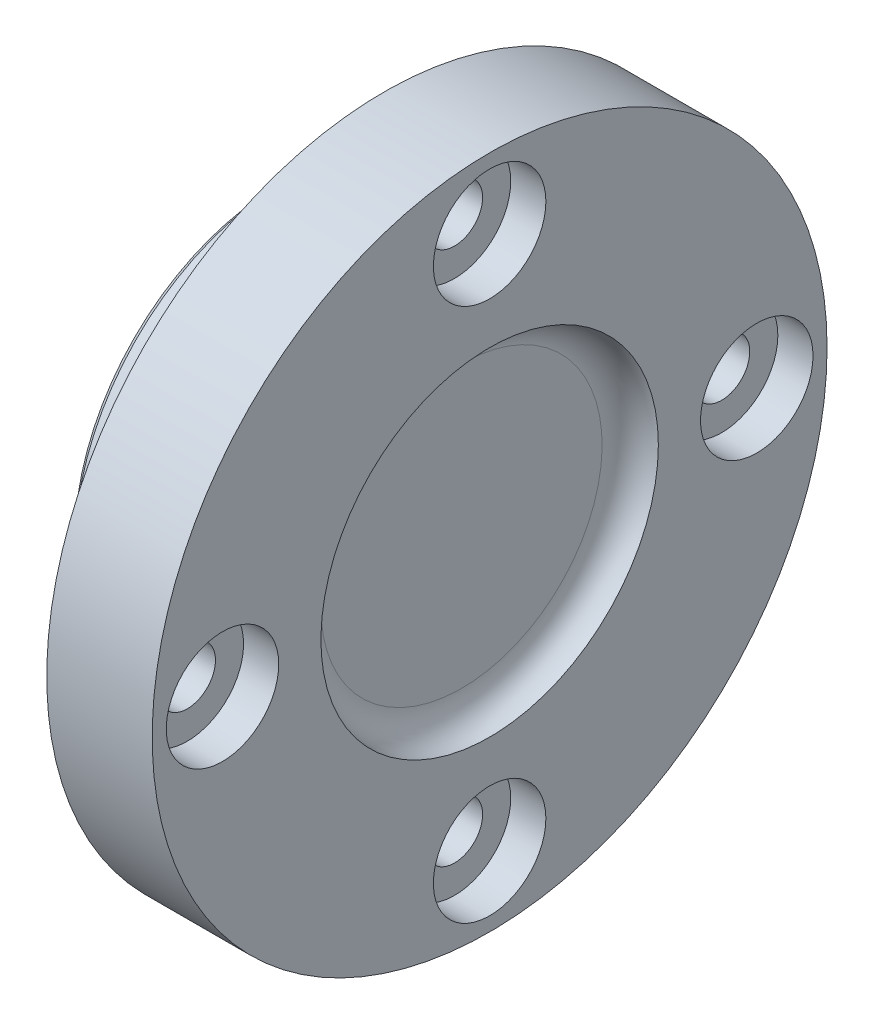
ISO-10303-21;
HEADER;
FILE_DESCRIPTION(('STEP AP214'),'2;1');
FILE_NAME('part.step','',(''),(''),'','','');
FILE_SCHEMA(('AUTOMOTIVE_DESIGN { 1 0 10303 214 1 1 1 1 }'));
ENDSEC;
DATA;
#1=APPLICATION_CONTEXT('core data for automotive mechanical design processes');
#2=APPLICATION_PROTOCOL_DEFINITION('international standard','automotive_design',2000,#1);
#3=PRODUCT_CONTEXT('',#1,'mechanical');
#4=PRODUCT('Part','Part','',(#3));
#5=PRODUCT_RELATED_PRODUCT_CATEGORY('part','',(#4));
#6=PRODUCT_DEFINITION_FORMATION('','',#4);
#7=PRODUCT_DEFINITION_CONTEXT('part definition',#1,'design');
#8=PRODUCT_DEFINITION('design','',#6,#7);
#9=PRODUCT_DEFINITION_SHAPE('','',#8);
#10=(LENGTH_UNIT() NAMED_UNIT(*) SI_UNIT(.MILLI.,.METRE.));
#11=(NAMED_UNIT(*) PLANE_ANGLE_UNIT() SI_UNIT($,.RADIAN.));
#12=(NAMED_UNIT(*) SI_UNIT($,.STERADIAN.) SOLID_ANGLE_UNIT());
#13=UNCERTAINTY_MEASURE_WITH_UNIT(LENGTH_MEASURE(1.E-05),#10,'distance_accuracy_value','');
#14=(GEOMETRIC_REPRESENTATION_CONTEXT(3) GLOBAL_UNCERTAINTY_ASSIGNED_CONTEXT((#13)) GLOBAL_UNIT_ASSIGNED_CONTEXT((#10,
#11,#12)) REPRESENTATION_CONTEXT('',''));
#15=CARTESIAN_POINT('',(0.,0.,0.));
#16=DIRECTION('',(0.,0.,1.));
#17=DIRECTION('',(1.,0.,0.));
#18=AXIS2_PLACEMENT_3D('',#15,#16,#17);
#19=CARTESIAN_POINT('',(15.,48.,0.));
#20=DIRECTION('',(-1.,0.,0.));
#21=DIRECTION('',(0.,0.,1.));
#22=AXIS2_PLACEMENT_3D('',#19,#20,#21);
#23=PLANE('',#22);
#24=CARTESIAN_POINT('',(15.,0.,-38.));
#25=DIRECTION('',(-1.,0.,0.));
#26=DIRECTION('',(0.,0.,1.));
#27=AXIS2_PLACEMENT_3D('',#24,#25,#26);
#28=CIRCLE('',#27,4.00000000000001);
#29=CARTESIAN_POINT('',(15.,0.,-34.));
#30=VERTEX_POINT('',#29);
#31=EDGE_CURVE('E151',#30,#30,#28,.T.);
#32=ORIENTED_EDGE('',*,*,#31,.F.);
#33=EDGE_LOOP('',(#32));
#34=FACE_BOUND('',#33,.T.);
#35=CARTESIAN_POINT('',(15.,38.,0.));
#36=DIRECTION('',(-1.,0.,0.));
#37=DIRECTION('',(0.,0.,1.));
#38=AXIS2_PLACEMENT_3D('',#35,#36,#37);
#39=CIRCLE('',#38,4.00000000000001);
#40=CARTESIAN_POINT('',(15.,38.,4.00000000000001));
#41=VERTEX_POINT('',#40);
#42=EDGE_CURVE('E139',#41,#41,#39,.T.);
#43=ORIENTED_EDGE('',*,*,#42,.F.);
#44=EDGE_LOOP('',(#43));
#45=FACE_BOUND('',#44,.T.);
#46=CARTESIAN_POINT('',(15.,-38.,0.));
#47=DIRECTION('',(-1.,0.,0.));
#48=DIRECTION('',(0.,0.,1.));
#49=AXIS2_PLACEMENT_3D('',#46,#47,#48);
#50=CIRCLE('',#49,4.00000000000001);
#51=CARTESIAN_POINT('',(15.,-38.,4.00000000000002));
#52=VERTEX_POINT('',#51);
#53=EDGE_CURVE('E127',#52,#52,#50,.T.);
#54=ORIENTED_EDGE('',*,*,#53,.F.);
#55=EDGE_LOOP('',(#54));
#56=FACE_BOUND('',#55,.T.);
#57=CARTESIAN_POINT('',(15.,0.,38.));
#58=DIRECTION('',(-1.,0.,0.));
#59=DIRECTION('',(0.,0.,1.));
#60=AXIS2_PLACEMENT_3D('',#57,#58,#59);
#61=CIRCLE('',#60,4.00000000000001);
#62=CARTESIAN_POINT('',(15.,0.,42.));
#63=VERTEX_POINT('',#62);
#64=EDGE_CURVE('E115',#63,#63,#61,.T.);
#65=ORIENTED_EDGE('',*,*,#64,.F.);
#66=EDGE_LOOP('',(#65));
#67=FACE_BOUND('',#66,.T.);
#68=CARTESIAN_POINT('',(15.,0.,0.));
#69=DIRECTION('',(1.,0.,0.));
#70=DIRECTION('',(0.,0.,-1.));
#71=AXIS2_PLACEMENT_3D('',#68,#69,#70);
#72=CIRCLE('',#71,48.);
#73=CARTESIAN_POINT('',(15.,0.,-48.));
#74=VERTEX_POINT('',#73);
#75=EDGE_CURVE('E198',#74,#74,#72,.T.);
#76=ORIENTED_EDGE('',*,*,#75,.F.);
#77=EDGE_LOOP('',(#76));
#78=FACE_BOUND('',#77,.T.);
#79=CARTESIAN_POINT('',(15.,0.,0.));
#80=DIRECTION('',(-1.,0.,0.));
#81=DIRECTION('',(0.,0.,1.));
#82=AXIS2_PLACEMENT_3D('',#79,#80,#81);
#83=CIRCLE('',#82,30.);
#84=CARTESIAN_POINT('',(15.,0.,30.));
#85=VERTEX_POINT('',#84);
#86=EDGE_CURVE('E199',#85,#85,#83,.T.);
#87=ORIENTED_EDGE('',*,*,#86,.F.);
#88=EDGE_LOOP('',(#87));
#89=FACE_BOUND('',#88,.T.);
#90=ADVANCED_FACE('F45',(#34,#45,#56,#67,#78,#89),#23,.T.);
#91=CARTESIAN_POINT('',(15.,0.,0.));
#92=DIRECTION('',(1.,0.,0.));
#93=DIRECTION('',(0.,0.,-1.));
#94=AXIS2_PLACEMENT_3D('',#91,#92,#93);
#95=CYLINDRICAL_SURFACE('',#94,48.);
#96=ORIENTED_EDGE('',*,*,#75,.T.);
#97=EDGE_LOOP('',(#96));
#98=FACE_BOUND('',#97,.T.);
#99=CARTESIAN_POINT('',(30.,0.,0.));
#100=DIRECTION('',(1.,0.,0.));
#101=DIRECTION('',(0.,0.,-1.));
#102=AXIS2_PLACEMENT_3D('',#99,#100,#101);
#103=CIRCLE('',#102,48.);
#104=CARTESIAN_POINT('',(30.,0.,-48.));
#105=VERTEX_POINT('',#104);
#106=EDGE_CURVE('E196',#105,#105,#103,.T.);
#107=ORIENTED_EDGE('',*,*,#106,.F.);
#108=EDGE_LOOP('',(#107));
#109=FACE_BOUND('',#108,.T.);
#110=ADVANCED_FACE('F47',(#98,#109),#95,.T.);
#111=CARTESIAN_POINT('',(30.,0.,0.));
#112=DIRECTION('',(1.,0.,0.));
#113=DIRECTION('',(0.,0.,-1.));
#114=AXIS2_PLACEMENT_3D('',#111,#112,#113);
#115=PLANE('',#114);
#116=CARTESIAN_POINT('',(30.,0.,-38.));
#117=DIRECTION('',(1.,0.,0.));
#118=DIRECTION('',(0.,0.,-1.));
#119=AXIS2_PLACEMENT_3D('',#116,#117,#118);
#120=CIRCLE('',#119,8.00000000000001);
#121=CARTESIAN_POINT('',(30.,0.,-46.));
#122=VERTEX_POINT('',#121);
#123=EDGE_CURVE('E154',#122,#122,#120,.T.);
#124=ORIENTED_EDGE('',*,*,#123,.F.);
#125=EDGE_LOOP('',(#124));
#126=FACE_BOUND('',#125,.T.);
#127=CARTESIAN_POINT('',(30.,38.,0.));
#128=DIRECTION('',(1.,0.,0.));
#129=DIRECTION('',(0.,0.,-1.));
#130=AXIS2_PLACEMENT_3D('',#127,#128,#129);
#131=CIRCLE('',#130,8.00000000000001);
#132=CARTESIAN_POINT('',(30.,38.,-8.00000000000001));
#133=VERTEX_POINT('',#132);
#134=EDGE_CURVE('E142',#133,#133,#131,.T.);
#135=ORIENTED_EDGE('',*,*,#134,.F.);
#136=EDGE_LOOP('',(#135));
#137=FACE_BOUND('',#136,.T.);
#138=CARTESIAN_POINT('',(30.,-38.,0.));
#139=DIRECTION('',(1.,0.,0.));
#140=DIRECTION('',(0.,0.,-1.));
#141=AXIS2_PLACEMENT_3D('',#138,#139,#140);
#142=CIRCLE('',#141,8.00000000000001);
#143=CARTESIAN_POINT('',(30.,-38.,-8.00000000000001));
#144=VERTEX_POINT('',#143);
#145=EDGE_CURVE('E130',#144,#144,#142,.T.);
#146=ORIENTED_EDGE('',*,*,#145,.F.);
#147=EDGE_LOOP('',(#146));
#148=FACE_BOUND('',#147,.T.);
#149=CARTESIAN_POINT('',(30.,0.,38.));
#150=DIRECTION('',(1.,0.,0.));
#151=DIRECTION('',(0.,0.,-1.));
#152=AXIS2_PLACEMENT_3D('',#149,#150,#151);
#153=CIRCLE('',#152,8.00000000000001);
#154=CARTESIAN_POINT('',(30.,0.,30.));
#155=VERTEX_POINT('',#154);
#156=EDGE_CURVE('E118',#155,#155,#153,.T.);
#157=ORIENTED_EDGE('',*,*,#156,.F.);
#158=EDGE_LOOP('',(#157));
#159=FACE_BOUND('',#158,.T.);
#160=CARTESIAN_POINT('',(30.,0.,0.));
#161=DIRECTION('',(1.,0.,0.));
#162=DIRECTION('',(0.,0.,-1.));
#163=AXIS2_PLACEMENT_3D('',#160,#161,#162);
#164=CIRCLE('',#163,24.);
#165=CARTESIAN_POINT('',(30.,0.,-24.));
#166=VERTEX_POINT('',#165);
#167=EDGE_CURVE('E81',#166,#166,#164,.F.);
#168=ORIENTED_EDGE('',*,*,#167,.T.);
#169=EDGE_LOOP('',(#168));
#170=FACE_BOUND('',#169,.T.);
#171=ORIENTED_EDGE('',*,*,#106,.T.);
#172=EDGE_LOOP('',(#171));
#173=FACE_BOUND('',#172,.T.);
#174=ADVANCED_FACE('F180',(#126,#137,#148,#159,#170,#173),#115,.T.);
#175=CARTESIAN_POINT('',(0.,0.,0.));
#176=DIRECTION('',(1.,0.,0.));
#177=DIRECTION('',(0.,0.,-1.));
#178=AXIS2_PLACEMENT_3D('',#175,#176,#177);
#179=CYLINDRICAL_SURFACE('',#178,30.);
#180=CARTESIAN_POINT('',(1.,0.,0.));
#181=DIRECTION('',(-1.,0.,0.));
#182=DIRECTION('',(0.,0.,1.));
#183=AXIS2_PLACEMENT_3D('',#180,#181,#182);
#184=CIRCLE('',#183,30.);
#185=CARTESIAN_POINT('',(1.,0.,30.));
#186=VERTEX_POINT('',#185);
#187=EDGE_CURVE('E11',#186,#186,#184,.F.);
#188=ORIENTED_EDGE('',*,*,#187,.T.);
#189=EDGE_LOOP('',(#188));
#190=FACE_BOUND('',#189,.T.);
#191=ORIENTED_EDGE('',*,*,#86,.T.);
#192=EDGE_LOOP('',(#191));
#193=FACE_BOUND('',#192,.T.);
#194=ADVANCED_FACE('F183',(#190,#193),#179,.T.);
#195=CARTESIAN_POINT('',(0.,0.,0.));
#196=DIRECTION('',(-1.,0.,0.));
#197=DIRECTION('',(0.,0.,1.));
#198=AXIS2_PLACEMENT_3D('',#195,#196,#197);
#199=PLANE('',#198);
#200=CARTESIAN_POINT('',(0.,0.,0.));
#201=DIRECTION('',(-1.,0.,0.));
#202=DIRECTION('',(0.,0.,1.));
#203=AXIS2_PLACEMENT_3D('',#200,#201,#202);
#204=CIRCLE('',#203,23.);
#205=CARTESIAN_POINT('',(0.,0.,23.));
#206=VERTEX_POINT('',#205);
#207=EDGE_CURVE('E53',#206,#206,#204,.F.);
#208=ORIENTED_EDGE('',*,*,#207,.T.);
#209=EDGE_LOOP('',(#208));
#210=FACE_BOUND('',#209,.T.);
#211=CARTESIAN_POINT('',(0.,0.,0.));
#212=DIRECTION('',(-1.,0.,0.));
#213=DIRECTION('',(0.,0.,1.));
#214=AXIS2_PLACEMENT_3D('',#211,#212,#213);
#215=CIRCLE('',#214,29.);
#216=CARTESIAN_POINT('',(0.,0.,29.));
#217=VERTEX_POINT('',#216);
#218=EDGE_CURVE('E211',#217,#217,#215,.T.);
#219=ORIENTED_EDGE('',*,*,#218,.T.);
#220=EDGE_LOOP('',(#219));
#221=FACE_BOUND('',#220,.T.);
#222=ADVANCED_FACE('F216',(#210,#221),#199,.T.);
#223=CARTESIAN_POINT('',(0.,0.,0.));
#224=DIRECTION('',(-1.,0.,0.));
#225=DIRECTION('',(0.,0.,1.));
#226=AXIS2_PLACEMENT_3D('',#223,#224,#225);
#227=CYLINDRICAL_SURFACE('',#226,22.);
#228=CARTESIAN_POINT('',(0.99999999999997,0.,0.));
#229=DIRECTION('',(-1.,0.,0.));
#230=DIRECTION('',(0.,0.,1.));
#231=AXIS2_PLACEMENT_3D('',#228,#229,#230);
#232=CIRCLE('',#231,22.);
#233=CARTESIAN_POINT('',(0.99999999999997,0.,22.));
#234=VERTEX_POINT('',#233);
#235=EDGE_CURVE('E202',#234,#234,#232,.T.);
#236=ORIENTED_EDGE('',*,*,#235,.T.);
#237=EDGE_LOOP('',(#236));
#238=FACE_BOUND('',#237,.T.);
#239=CARTESIAN_POINT('',(18.,0.,0.));
#240=DIRECTION('',(-1.,0.,0.));
#241=DIRECTION('',(0.,0.,1.));
#242=AXIS2_PLACEMENT_3D('',#239,#240,#241);
#243=CIRCLE('',#242,22.);
#244=CARTESIAN_POINT('',(18.,0.,22.));
#245=VERTEX_POINT('',#244);
#246=EDGE_CURVE('E205',#245,#245,#243,.T.);
#247=ORIENTED_EDGE('',*,*,#246,.F.);
#248=EDGE_LOOP('',(#247));
#249=FACE_BOUND('',#248,.T.);
#250=ADVANCED_FACE('F225',(#238,#249),#227,.F.);
#251=CARTESIAN_POINT('',(18.,0.,0.));
#252=DIRECTION('',(1.,0.,0.));
#253=DIRECTION('',(0.,0.,-1.));
#254=AXIS2_PLACEMENT_3D('',#251,#252,#253);
#255=PLANE('',#254);
#256=CARTESIAN_POINT('',(18.,0.,0.));
#257=DIRECTION('',(1.,0.,0.));
#258=DIRECTION('',(0.,0.,-1.));
#259=AXIS2_PLACEMENT_3D('',#256,#257,#258);
#260=CIRCLE('',#259,20.);
#261=CARTESIAN_POINT('',(18.,0.,-20.));
#262=VERTEX_POINT('',#261);
#263=EDGE_CURVE('E87',#262,#262,#260,.F.);
#264=ORIENTED_EDGE('',*,*,#263,.F.);
#265=EDGE_LOOP('',(#264));
#266=FACE_BOUND('',#265,.T.);
#267=ORIENTED_EDGE('',*,*,#246,.T.);
#268=EDGE_LOOP('',(#267));
#269=FACE_BOUND('',#268,.T.);
#270=ADVANCED_FACE('F228',(#266,#269),#255,.F.);
#271=CARTESIAN_POINT('',(18.,0.,0.));
#272=DIRECTION('',(1.,0.,0.));
#273=DIRECTION('',(0.,0.877582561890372,0.479425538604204));
#274=AXIS2_PLACEMENT_3D('',#271,#272,#273);
#275=TOROIDAL_SURFACE('',#274,16.,4.);
#276=CARTESIAN_POINT('',(22.,0.,0.));
#277=DIRECTION('',(1.,0.,0.));
#278=DIRECTION('',(0.,-0.87758256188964,-0.479425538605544));
#279=AXIS2_PLACEMENT_3D('',#276,#277,#278);
#280=CIRCLE('',#279,15.999999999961);
#281=CARTESIAN_POINT('',(22.,14.0413209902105,7.670808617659));
#282=VERTEX_POINT('',#281);
#283=CARTESIAN_POINT('',(22.,-14.0413209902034,-7.67080861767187));
#284=VERTEX_POINT('',#283);
#285=EDGE_CURVE('E59',#282,#284,#280,.F.);
#286=ORIENTED_EDGE('',*,*,#285,.F.);
#287=CARTESIAN_POINT('',(22.,0.,0.));
#288=DIRECTION('',(1.,0.,0.));
#289=DIRECTION('',(0.,0.877582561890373,0.479425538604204));
#290=AXIS2_PLACEMENT_3D('',#287,#288,#289);
#291=CIRCLE('',#290,15.999999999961);
#292=EDGE_CURVE('E233',#284,#282,#291,.F.);
#293=ORIENTED_EDGE('',*,*,#292,.F.);
#294=EDGE_LOOP('',(#286,#293));
#295=FACE_BOUND('',#294,.T.);
#296=ORIENTED_EDGE('',*,*,#263,.T.);
#297=EDGE_LOOP('',(#296));
#298=FACE_BOUND('',#297,.T.);
#299=ADVANCED_FACE('F252',(#295,#298),#275,.F.);
#300=CARTESIAN_POINT('',(22.,16.,0.));
#301=DIRECTION('',(1.,0.,0.));
#302=DIRECTION('',(0.,0.,-1.));
#303=AXIS2_PLACEMENT_3D('',#300,#301,#302);
#304=PLANE('',#303);
#305=ORIENTED_EDGE('',*,*,#285,.T.);
#306=ORIENTED_EDGE('',*,*,#292,.T.);
#307=EDGE_LOOP('',(#305,#306));
#308=FACE_BOUND('',#307,.T.);
#309=ADVANCED_FACE('F105',(#308),#304,.F.);
#310=CARTESIAN_POINT('',(30.,0.,0.));
#311=DIRECTION('',(1.,0.,0.));
#312=DIRECTION('',(0.,0.877582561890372,0.479425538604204));
#313=AXIS2_PLACEMENT_3D('',#310,#311,#312);
#314=TOROIDAL_SURFACE('',#313,20.,4.);
#315=ORIENTED_EDGE('',*,*,#167,.F.);
#316=EDGE_LOOP('',(#315));
#317=FACE_BOUND('',#316,.T.);
#318=CARTESIAN_POINT('',(26.,0.,0.));
#319=DIRECTION('',(-1.,0.,0.));
#320=DIRECTION('',(0.,0.877582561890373,0.479425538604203));
#321=AXIS2_PLACEMENT_3D('',#318,#319,#320);
#322=CIRCLE('',#321,19.9999999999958);
#323=CARTESIAN_POINT('',(26.,-17.551651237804,-9.58851077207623));
#324=VERTEX_POINT('',#323);
#325=CARTESIAN_POINT('',(26.,17.5516512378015,9.58851077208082));
#326=VERTEX_POINT('',#325);
#327=EDGE_CURVE('E72',#324,#326,#322,.F.);
#328=ORIENTED_EDGE('',*,*,#327,.F.);
#329=CARTESIAN_POINT('',(26.,0.,0.));
#330=DIRECTION('',(-1.,0.,0.));
#331=DIRECTION('',(0.,-0.877582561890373,-0.479425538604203));
#332=AXIS2_PLACEMENT_3D('',#329,#330,#331);
#333=CIRCLE('',#332,19.9999999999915);
#334=EDGE_CURVE('E76',#326,#324,#333,.F.);
#335=ORIENTED_EDGE('',*,*,#334,.F.);
#336=EDGE_LOOP('',(#328,#335));
#337=FACE_BOUND('',#336,.T.);
#338=ADVANCED_FACE('F85',(#317,#337),#314,.F.);
#339=CARTESIAN_POINT('',(26.,0.,0.));
#340=DIRECTION('',(1.,0.,0.));
#341=DIRECTION('',(0.,0.,-1.));
#342=AXIS2_PLACEMENT_3D('',#339,#340,#341);
#343=PLANE('',#342);
#344=ORIENTED_EDGE('',*,*,#334,.T.);
#345=ORIENTED_EDGE('',*,*,#327,.T.);
#346=EDGE_LOOP('',(#344,#345));
#347=FACE_BOUND('',#346,.T.);
#348=ADVANCED_FACE('F75',(#347),#343,.T.);
#349=CARTESIAN_POINT('',(30.,0.,38.));
#350=DIRECTION('',(1.,0.,0.));
#351=DIRECTION('',(0.,0.,-1.));
#352=AXIS2_PLACEMENT_3D('',#349,#350,#351);
#353=CYLINDRICAL_SURFACE('',#352,4.00000000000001);
#354=CARTESIAN_POINT('',(25.,0.,38.));
#355=DIRECTION('',(1.,0.,0.));
#356=DIRECTION('',(0.,0.,-1.));
#357=AXIS2_PLACEMENT_3D('',#354,#355,#356);
#358=CIRCLE('',#357,4.00000000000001);
#359=CARTESIAN_POINT('',(25.,0.,34.));
#360=VERTEX_POINT('',#359);
#361=EDGE_CURVE('E124',#360,#360,#358,.T.);
#362=ORIENTED_EDGE('',*,*,#361,.T.);
#363=EDGE_LOOP('',(#362));
#364=FACE_BOUND('',#363,.T.);
#365=ORIENTED_EDGE('',*,*,#64,.T.);
#366=EDGE_LOOP('',(#365));
#367=FACE_BOUND('',#366,.T.);
#368=ADVANCED_FACE('F107',(#364,#367),#353,.F.);
#369=CARTESIAN_POINT('',(30.,0.,38.));
#370=DIRECTION('',(1.,0.,0.));
#371=DIRECTION('',(0.,0.,-1.));
#372=AXIS2_PLACEMENT_3D('',#369,#370,#371);
#373=CYLINDRICAL_SURFACE('',#372,8.00000000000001);
#374=CARTESIAN_POINT('',(25.,0.,38.));
#375=DIRECTION('',(1.,0.,0.));
#376=DIRECTION('',(0.,0.,-1.));
#377=AXIS2_PLACEMENT_3D('',#374,#375,#376);
#378=CIRCLE('',#377,8.00000000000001);
#379=CARTESIAN_POINT('',(25.,0.,30.));
#380=VERTEX_POINT('',#379);
#381=EDGE_CURVE('E121',#380,#380,#378,.T.);
#382=ORIENTED_EDGE('',*,*,#381,.F.);
#383=EDGE_LOOP('',(#382));
#384=FACE_BOUND('',#383,.T.);
#385=ORIENTED_EDGE('',*,*,#156,.T.);
#386=EDGE_LOOP('',(#385));
#387=FACE_BOUND('',#386,.T.);
#388=ADVANCED_FACE('F108',(#384,#387),#373,.F.);
#389=CARTESIAN_POINT('',(25.,4.00000000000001,38.));
#390=DIRECTION('',(-1.,0.,0.));
#391=DIRECTION('',(0.,0.,1.));
#392=AXIS2_PLACEMENT_3D('',#389,#390,#391);
#393=PLANE('',#392);
#394=ORIENTED_EDGE('',*,*,#361,.F.);
#395=EDGE_LOOP('',(#394));
#396=FACE_BOUND('',#395,.T.);
#397=ORIENTED_EDGE('',*,*,#381,.T.);
#398=EDGE_LOOP('',(#397));
#399=FACE_BOUND('',#398,.T.);
#400=ADVANCED_FACE('F361',(#396,#399),#393,.F.);
#401=CARTESIAN_POINT('',(30.,-38.,0.));
#402=DIRECTION('',(1.,0.,0.));
#403=DIRECTION('',(0.,0.,-1.));
#404=AXIS2_PLACEMENT_3D('',#401,#402,#403);
#405=CYLINDRICAL_SURFACE('',#404,4.00000000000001);
#406=CARTESIAN_POINT('',(25.,-38.,0.));
#407=DIRECTION('',(1.,0.,0.));
#408=DIRECTION('',(0.,0.,-1.));
#409=AXIS2_PLACEMENT_3D('',#406,#407,#408);
#410=CIRCLE('',#409,4.00000000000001);
#411=CARTESIAN_POINT('',(25.,-38.,-4.00000000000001));
#412=VERTEX_POINT('',#411);
#413=EDGE_CURVE('E136',#412,#412,#410,.T.);
#414=ORIENTED_EDGE('',*,*,#413,.T.);
#415=EDGE_LOOP('',(#414));
#416=FACE_BOUND('',#415,.T.);
#417=ORIENTED_EDGE('',*,*,#53,.T.);
#418=EDGE_LOOP('',(#417));
#419=FACE_BOUND('',#418,.T.);
#420=ADVANCED_FACE('F369',(#416,#419),#405,.F.);
#421=CARTESIAN_POINT('',(30.,-38.,0.));
#422=DIRECTION('',(1.,0.,0.));
#423=DIRECTION('',(0.,0.,-1.));
#424=AXIS2_PLACEMENT_3D('',#421,#422,#423);
#425=CYLINDRICAL_SURFACE('',#424,8.00000000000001);
#426=CARTESIAN_POINT('',(25.,-38.,0.));
#427=DIRECTION('',(1.,0.,0.));
#428=DIRECTION('',(0.,0.,-1.));
#429=AXIS2_PLACEMENT_3D('',#426,#427,#428);
#430=CIRCLE('',#429,8.00000000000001);
#431=CARTESIAN_POINT('',(25.,-38.,-8.00000000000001));
#432=VERTEX_POINT('',#431);
#433=EDGE_CURVE('E133',#432,#432,#430,.T.);
#434=ORIENTED_EDGE('',*,*,#433,.F.);
#435=EDGE_LOOP('',(#434));
#436=FACE_BOUND('',#435,.T.);
#437=ORIENTED_EDGE('',*,*,#145,.T.);
#438=EDGE_LOOP('',(#437));
#439=FACE_BOUND('',#438,.T.);
#440=ADVANCED_FACE('F377',(#436,#439),#425,.F.);
#441=CARTESIAN_POINT('',(25.,-34.,0.));
#442=DIRECTION('',(-1.,0.,0.));
#443=DIRECTION('',(0.,0.,1.));
#444=AXIS2_PLACEMENT_3D('',#441,#442,#443);
#445=PLANE('',#444);
#446=ORIENTED_EDGE('',*,*,#413,.F.);
#447=EDGE_LOOP('',(#446));
#448=FACE_BOUND('',#447,.T.);
#449=ORIENTED_EDGE('',*,*,#433,.T.);
#450=EDGE_LOOP('',(#449));
#451=FACE_BOUND('',#450,.T.);
#452=ADVANCED_FACE('F386',(#448,#451),#445,.F.);
#453=CARTESIAN_POINT('',(30.,38.,0.));
#454=DIRECTION('',(1.,0.,0.));
#455=DIRECTION('',(0.,0.,-1.));
#456=AXIS2_PLACEMENT_3D('',#453,#454,#455);
#457=CYLINDRICAL_SURFACE('',#456,4.00000000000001);
#458=CARTESIAN_POINT('',(25.,38.,0.));
#459=DIRECTION('',(1.,0.,0.));
#460=DIRECTION('',(0.,0.,-1.));
#461=AXIS2_PLACEMENT_3D('',#458,#459,#460);
#462=CIRCLE('',#461,4.00000000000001);
#463=CARTESIAN_POINT('',(25.,38.,-4.00000000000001));
#464=VERTEX_POINT('',#463);
#465=EDGE_CURVE('E148',#464,#464,#462,.T.);
#466=ORIENTED_EDGE('',*,*,#465,.T.);
#467=EDGE_LOOP('',(#466));
#468=FACE_BOUND('',#467,.T.);
#469=ORIENTED_EDGE('',*,*,#42,.T.);
#470=EDGE_LOOP('',(#469));
#471=FACE_BOUND('',#470,.T.);
#472=ADVANCED_FACE('F395',(#468,#471),#457,.F.);
#473=CARTESIAN_POINT('',(30.,38.,0.));
#474=DIRECTION('',(1.,0.,0.));
#475=DIRECTION('',(0.,0.,-1.));
#476=AXIS2_PLACEMENT_3D('',#473,#474,#475);
#477=CYLINDRICAL_SURFACE('',#476,8.00000000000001);
#478=CARTESIAN_POINT('',(25.,38.,0.));
#479=DIRECTION('',(1.,0.,0.));
#480=DIRECTION('',(0.,0.,-1.));
#481=AXIS2_PLACEMENT_3D('',#478,#479,#480);
#482=CIRCLE('',#481,8.00000000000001);
#483=CARTESIAN_POINT('',(25.,38.,-8.00000000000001));
#484=VERTEX_POINT('',#483);
#485=EDGE_CURVE('E145',#484,#484,#482,.T.);
#486=ORIENTED_EDGE('',*,*,#485,.F.);
#487=EDGE_LOOP('',(#486));
#488=FACE_BOUND('',#487,.T.);
#489=ORIENTED_EDGE('',*,*,#134,.T.);
#490=EDGE_LOOP('',(#489));
#491=FACE_BOUND('',#490,.T.);
#492=ADVANCED_FACE('F404',(#488,#491),#477,.F.);
#493=CARTESIAN_POINT('',(25.,42.,0.));
#494=DIRECTION('',(-1.,0.,0.));
#495=DIRECTION('',(0.,0.,1.));
#496=AXIS2_PLACEMENT_3D('',#493,#494,#495);
#497=PLANE('',#496);
#498=ORIENTED_EDGE('',*,*,#465,.F.);
#499=EDGE_LOOP('',(#498));
#500=FACE_BOUND('',#499,.T.);
#501=ORIENTED_EDGE('',*,*,#485,.T.);
#502=EDGE_LOOP('',(#501));
#503=FACE_BOUND('',#502,.T.);
#504=ADVANCED_FACE('F413',(#500,#503),#497,.F.);
#505=CARTESIAN_POINT('',(30.,0.,-38.));
#506=DIRECTION('',(1.,0.,0.));
#507=DIRECTION('',(0.,0.,-1.));
#508=AXIS2_PLACEMENT_3D('',#505,#506,#507);
#509=CYLINDRICAL_SURFACE('',#508,4.00000000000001);
#510=CARTESIAN_POINT('',(25.,0.,-38.));
#511=DIRECTION('',(1.,0.,0.));
#512=DIRECTION('',(0.,0.,-1.));
#513=AXIS2_PLACEMENT_3D('',#510,#511,#512);
#514=CIRCLE('',#513,4.00000000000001);
#515=CARTESIAN_POINT('',(25.,0.,-42.));
#516=VERTEX_POINT('',#515);
#517=EDGE_CURVE('E160',#516,#516,#514,.T.);
#518=ORIENTED_EDGE('',*,*,#517,.T.);
#519=EDGE_LOOP('',(#518));
#520=FACE_BOUND('',#519,.T.);
#521=ORIENTED_EDGE('',*,*,#31,.T.);
#522=EDGE_LOOP('',(#521));
#523=FACE_BOUND('',#522,.T.);
#524=ADVANCED_FACE('F164',(#520,#523),#509,.F.);
#525=CARTESIAN_POINT('',(30.,0.,-38.));
#526=DIRECTION('',(1.,0.,0.));
#527=DIRECTION('',(0.,0.,-1.));
#528=AXIS2_PLACEMENT_3D('',#525,#526,#527);
#529=CYLINDRICAL_SURFACE('',#528,8.00000000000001);
#530=CARTESIAN_POINT('',(25.,0.,-38.));
#531=DIRECTION('',(1.,0.,0.));
#532=DIRECTION('',(0.,0.,-1.));
#533=AXIS2_PLACEMENT_3D('',#530,#531,#532);
#534=CIRCLE('',#533,8.00000000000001);
#535=CARTESIAN_POINT('',(25.,0.,-46.));
#536=VERTEX_POINT('',#535);
#537=EDGE_CURVE('E157',#536,#536,#534,.T.);
#538=ORIENTED_EDGE('',*,*,#537,.F.);
#539=EDGE_LOOP('',(#538));
#540=FACE_BOUND('',#539,.T.);
#541=ORIENTED_EDGE('',*,*,#123,.T.);
#542=EDGE_LOOP('',(#541));
#543=FACE_BOUND('',#542,.T.);
#544=ADVANCED_FACE('F171',(#540,#543),#529,.F.);
#545=CARTESIAN_POINT('',(25.,4.,-38.));
#546=DIRECTION('',(-1.,0.,0.));
#547=DIRECTION('',(0.,0.,1.));
#548=AXIS2_PLACEMENT_3D('',#545,#546,#547);
#549=PLANE('',#548);
#550=ORIENTED_EDGE('',*,*,#517,.F.);
#551=EDGE_LOOP('',(#550));
#552=FACE_BOUND('',#551,.T.);
#553=ORIENTED_EDGE('',*,*,#537,.T.);
#554=EDGE_LOOP('',(#553));
#555=FACE_BOUND('',#554,.T.);
#556=ADVANCED_FACE('F167',(#552,#555),#549,.F.);
#557=CARTESIAN_POINT('',(0.99999999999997,0.,0.));
#558=DIRECTION('',(-1.,0.,0.));
#559=DIRECTION('',(0.,0.,1.));
#560=AXIS2_PLACEMENT_3D('',#557,#558,#559);
#561=CONICAL_SURFACE('',#560,22.,0.785398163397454);
#562=ORIENTED_EDGE('',*,*,#207,.F.);
#563=EDGE_LOOP('',(#562));
#564=FACE_BOUND('',#563,.T.);
#565=ORIENTED_EDGE('',*,*,#235,.F.);
#566=EDGE_LOOP('',(#565));
#567=FACE_BOUND('',#566,.T.);
#568=ADVANCED_FACE('F170',(#564,#567),#561,.F.);
#569=CARTESIAN_POINT('',(0.,0.,0.));
#570=DIRECTION('',(1.,0.,0.));
#571=DIRECTION('',(0.,0.,-1.));
#572=AXIS2_PLACEMENT_3D('',#569,#570,#571);
#573=CONICAL_SURFACE('',#572,29.,0.785398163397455);
#574=ORIENTED_EDGE('',*,*,#187,.F.);
#575=EDGE_LOOP('',(#574));
#576=FACE_BOUND('',#575,.T.);
#577=ORIENTED_EDGE('',*,*,#218,.F.);
#578=EDGE_LOOP('',(#577));
#579=FACE_BOUND('',#578,.T.);
#580=ADVANCED_FACE('F221',(#576,#579),#573,.T.);
#581=CLOSED_SHELL('',(#90,#110,#174,#194,#222,#250,#270,#299,#309,#338,#348,#368,#388,#400,#420,
#440,#452,#472,#492,#504,#524,#544,#556,#568,#580));
#582=MANIFOLD_SOLID_BREP('B2',#581);
#583=ADVANCED_BREP_SHAPE_REPRESENTATION('',(#18,#582),#14);
#584=SHAPE_DEFINITION_REPRESENTATION(#9,#583);
ENDSEC;
END-ISO-10303-21;
